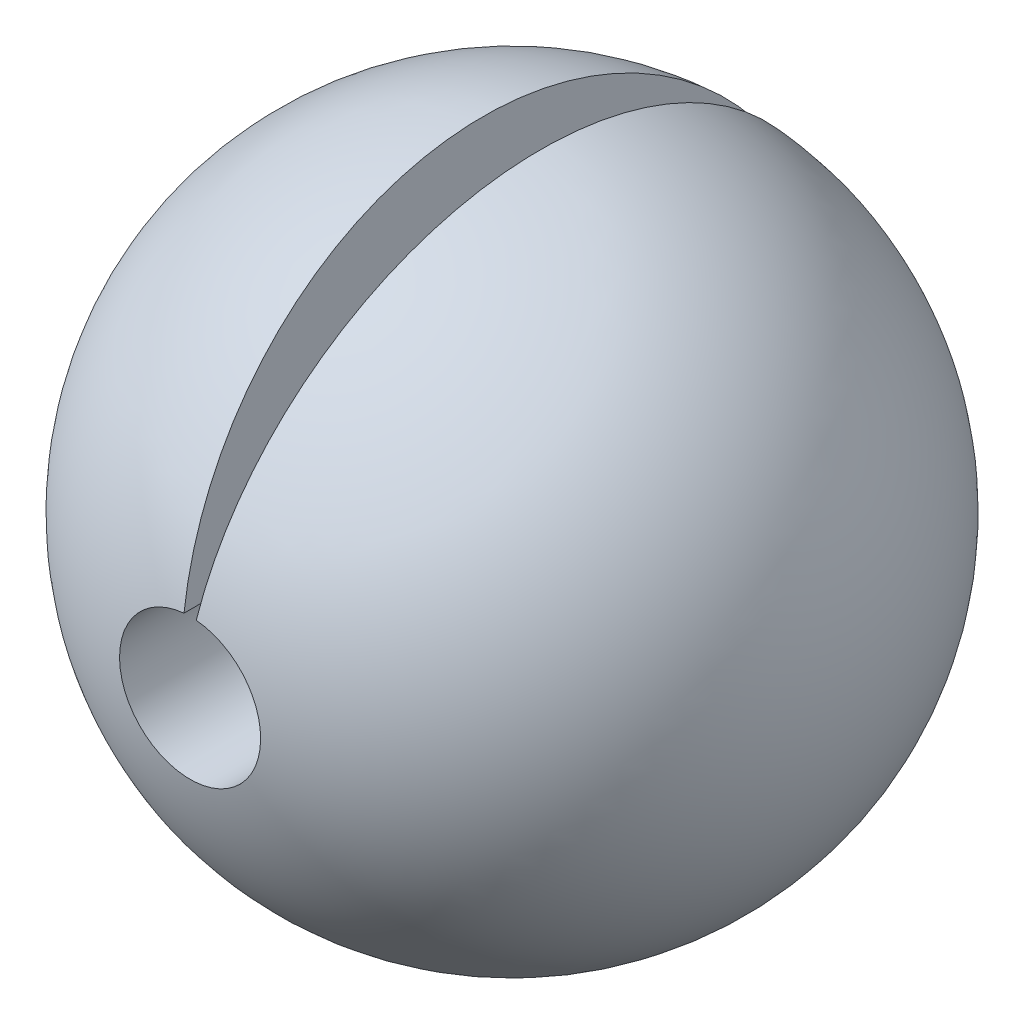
from build123d import *

# Parameters (mm, degrees)
CUT_EXTRUDE_1_DEPTH      = 1623.300835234
CUT_EXTRUDE_1_DEPTH_BACK = 1623.300835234


with BuildPart() as part:
    # Sketch 1 → Revolve 1 (revolve)
    with BuildSketch(Plane(origin=(0, 0, 0), x_dir=(1, 0, 0), z_dir=(0, 1, 0))):
        with BuildLine():
            Line((-202, 922), (-202, -922))
            ThreePointArc((-202, -922), (-943.868634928, 0), (-202, 922))
        make_face()
    revolve(axis=Axis((0, 0, 0), (0, 0, -1)))

    # Sketch 2 → Cut-Extrude 1 (cut, two sides: drawn at the far end of the back side and taken through both)
    with BuildSketch(Plane.XY.offset(-CUT_EXTRUDE_1_DEPTH_BACK)):
        Polygon((0, 0), (-88.834663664, 1015.384851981), (88.834663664, 1015.384851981), align=None)
    extrude(amount=CUT_EXTRUDE_1_DEPTH + CUT_EXTRUDE_1_DEPTH_BACK, mode=Mode.SUBTRACT)


solid = part.part
